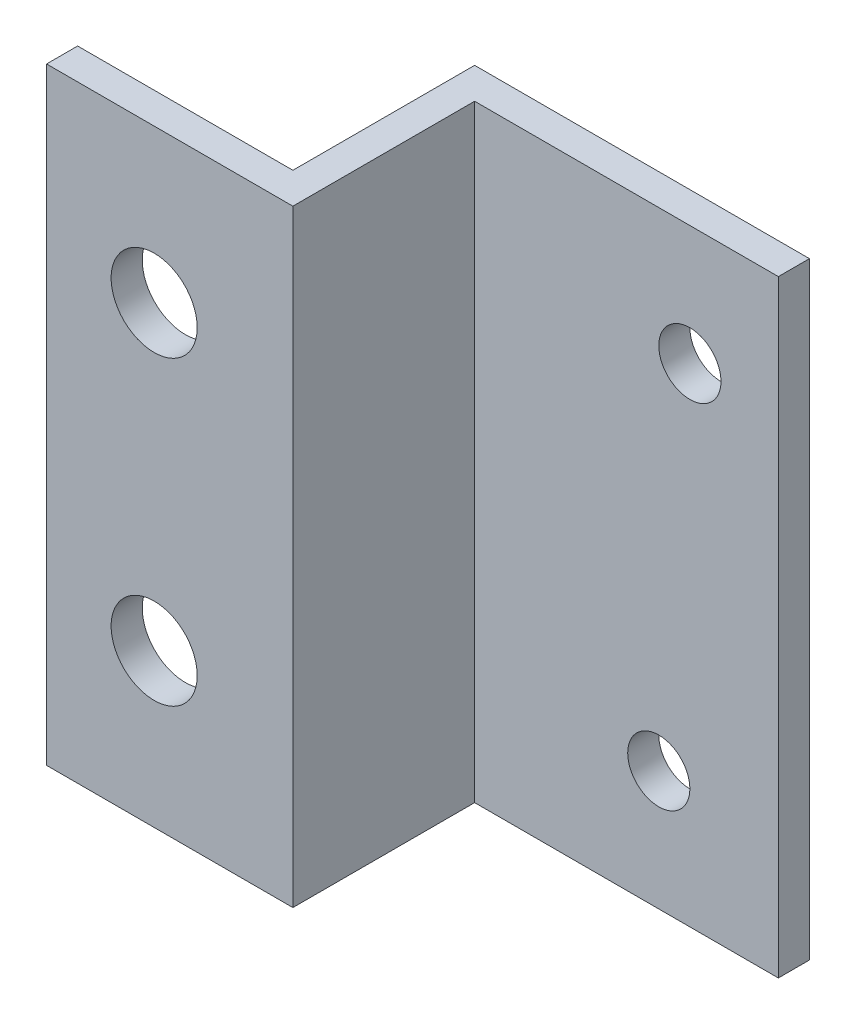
from build123d import *

# Parameters (mm, degrees)
BOSS_EXTRUDE1_DEPTH = 63.5
SKETCH3_R           = 9
SKETCH3_R_2         = 6.5
CUT_EXTRUDE1_DEPTH  = 101.223500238


with BuildPart() as part:
    # Sketch2 → Boss-Extrude1 (new, symmetric)
    with BuildSketch(Plane(origin=(0, 0, 0), x_dir=(1, 0, 0), z_dir=(0, 1, 0))):
        Polygon((-51.5, 0), (0, 0), (0, 38), (63.5, 38), (63.5, 44.5), (-6.5, 44.5), (-6.5, 38), (-6.5, 6.5), (-51.5, 6.5), align=None)
    extrude(amount=BOSS_EXTRUDE1_DEPTH, both=True)

    # Sketch3 → Cut-Extrude1 (cut, through all)
    with BuildSketch(Plane.XY):
        with Locations((-29, 31.5)):
            Circle(SKETCH3_R)
        with Locations((-29, -31.5)):
            Circle(SKETCH3_R)
        with Locations((45, 38.5)):
            Circle(SKETCH3_R_2)
        with Locations((38.5, -38.5)):
            Circle(SKETCH3_R_2)
    extrude(amount=-CUT_EXTRUDE1_DEPTH, mode=Mode.SUBTRACT)


solid = part.part
